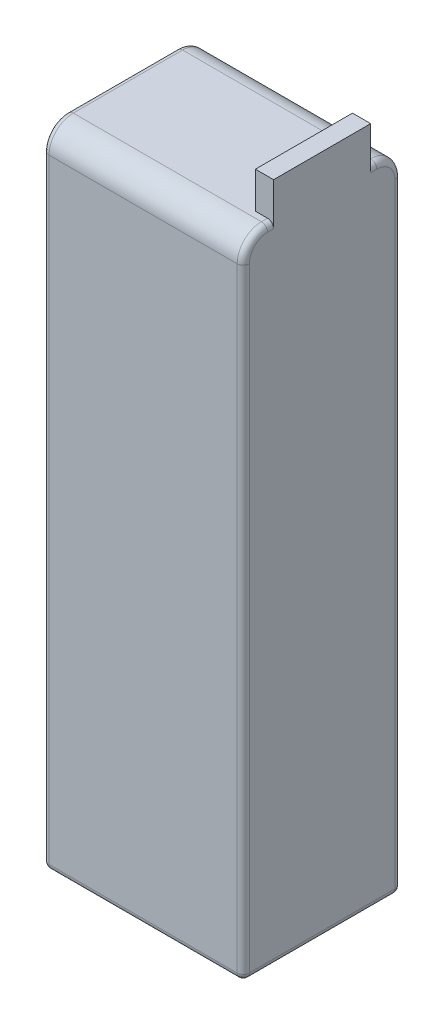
from build123d import *

# Parameters (mm, degrees)
SKETCH1_W           = 41.91
SKETCH1_H           = 33.02
BOSS_EXTRUDE1_DEPTH = 67.437
SKETCH2_W           = 3.81
SKETCH2_H           = 20.32
BOSS_EXTRUDE2_DEPTH = 7.62
FILLET1_R           = 5.08
FILLET2_R           = 1.27


with BuildPart() as part:
    # Sketch1 → Boss-Extrude1 (new, symmetric)
    with BuildSketch(Plane(origin=(0, 0, 0), x_dir=(1, 0, 0), z_dir=(0, 1, 0))):
        Rectangle(SKETCH1_W, SKETCH1_H)
    extrude(amount=BOSS_EXTRUDE1_DEPTH, both=True)

    # Sketch2 → Boss-Extrude2 (add)
    with BuildSketch(Plane(origin=(0, 67.437, 0), x_dir=(1, 0, 0), z_dir=(0, 1, 0))):
        with Locations((19.05, 0)):
            Rectangle(SKETCH2_W, SKETCH2_H)
    extrude(amount=BOSS_EXTRUDE2_DEPTH)

    # Fillet1
    fillet1_edges = [part.edges().sort_by_distance(p)[0] for p in [
        (0, 67.437, 16.51),
        (0, 67.437, -16.51),
    ]]
    fillet(fillet1_edges, radius=FILLET1_R)

    # Fillet2
    fillet2_edges = [part.edges().sort_by_distance(p)[0] for p in [
        (20.955, 67.437, -10.795),
        (-20.955, 67.437, 0),
        (20.955, 67.437, 10.795),
        (-20.955, -2.54, 16.51),
        (-20.955, -2.54, -16.51),
        (-20.955, 65.949102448, 15.022102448),
        (-20.955, 65.949102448, -15.022102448),
        (20.955, -2.54, -16.51),
        (20.955, -2.54, 16.51),
        (20.955, 65.949102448, 15.022102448),
        (20.955, 65.949102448, -15.022102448),
        (0, -67.437, 16.51),
        (-20.955, -67.437, 0),
        (0, -67.437, -16.51),
        (20.955, -67.437, 0),
    ]]
    fillet(fillet2_edges, radius=FILLET2_R)


solid = part.part
